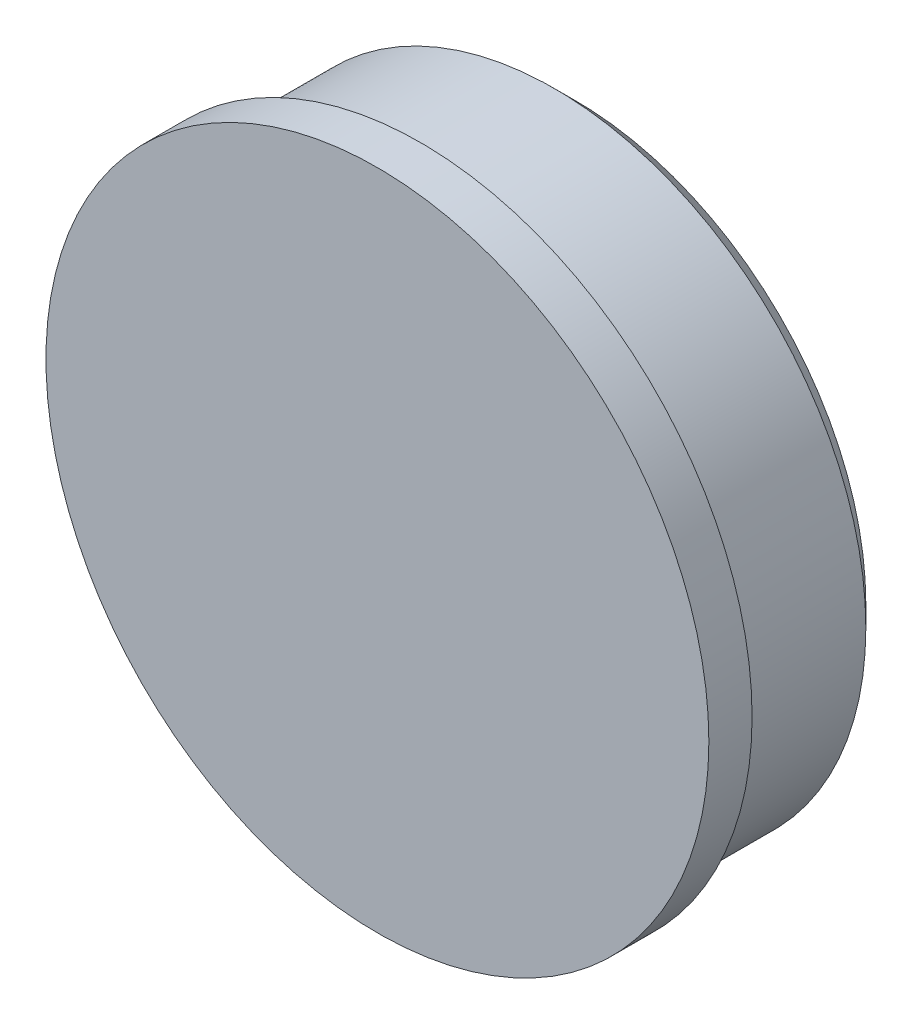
ISO-10303-21;
HEADER;
FILE_DESCRIPTION(('STEP AP214'),'2;1');
FILE_NAME('part.step','',(''),(''),'','','');
FILE_SCHEMA(('AUTOMOTIVE_DESIGN { 1 0 10303 214 1 1 1 1 }'));
ENDSEC;
DATA;
#1=APPLICATION_CONTEXT('core data for automotive mechanical design processes');
#2=APPLICATION_PROTOCOL_DEFINITION('international standard','automotive_design',2000,#1);
#3=PRODUCT_CONTEXT('',#1,'mechanical');
#4=PRODUCT('Part','Part','',(#3));
#5=PRODUCT_RELATED_PRODUCT_CATEGORY('part','',(#4));
#6=PRODUCT_DEFINITION_FORMATION('','',#4);
#7=PRODUCT_DEFINITION_CONTEXT('part definition',#1,'design');
#8=PRODUCT_DEFINITION('design','',#6,#7);
#9=PRODUCT_DEFINITION_SHAPE('','',#8);
#10=(LENGTH_UNIT() NAMED_UNIT(*) SI_UNIT(.MILLI.,.METRE.));
#11=(NAMED_UNIT(*) PLANE_ANGLE_UNIT() SI_UNIT($,.RADIAN.));
#12=(NAMED_UNIT(*) SI_UNIT($,.STERADIAN.) SOLID_ANGLE_UNIT());
#13=UNCERTAINTY_MEASURE_WITH_UNIT(LENGTH_MEASURE(1.E-05),#10,'distance_accuracy_value','');
#14=(GEOMETRIC_REPRESENTATION_CONTEXT(3) GLOBAL_UNCERTAINTY_ASSIGNED_CONTEXT((#13)) GLOBAL_UNIT_ASSIGNED_CONTEXT((#10,
#11,#12)) REPRESENTATION_CONTEXT('',''));
#15=CARTESIAN_POINT('',(0.,0.,0.));
#16=DIRECTION('',(0.,0.,1.));
#17=DIRECTION('',(1.,0.,0.));
#18=AXIS2_PLACEMENT_3D('',#15,#16,#17);
#19=CARTESIAN_POINT('',(0.,0.,0.));
#20=DIRECTION('',(0.,0.,-1.));
#21=DIRECTION('',(-1.,0.,0.));
#22=AXIS2_PLACEMENT_3D('',#19,#20,#21);
#23=PLANE('',#22);
#24=CARTESIAN_POINT('',(0.,0.,0.));
#25=DIRECTION('',(0.,0.,1.));
#26=DIRECTION('',(1.,0.,0.));
#27=AXIS2_PLACEMENT_3D('',#24,#25,#26);
#28=CIRCLE('',#27,12.6365);
#29=CARTESIAN_POINT('',(12.6365,0.,0.));
#30=VERTEX_POINT('',#29);
#31=EDGE_CURVE('E10',#30,#30,#28,.T.);
#32=ORIENTED_EDGE('',*,*,#31,.T.);
#33=EDGE_LOOP('',(#32));
#34=FACE_BOUND('',#33,.T.);
#35=ADVANCED_FACE('F33',(#34),#23,.F.);
#36=CARTESIAN_POINT('',(0.,0.,0.));
#37=DIRECTION('',(0.,0.,1.));
#38=DIRECTION('',(1.,0.,0.));
#39=AXIS2_PLACEMENT_3D('',#36,#37,#38);
#40=CYLINDRICAL_SURFACE('',#39,12.6365);
#41=ORIENTED_EDGE('',*,*,#31,.F.);
#42=EDGE_LOOP('',(#41));
#43=FACE_BOUND('',#42,.T.);
#44=CARTESIAN_POINT('',(0.,0.,-1.647825));
#45=DIRECTION('',(0.,0.,1.));
#46=DIRECTION('',(1.,0.,0.));
#47=AXIS2_PLACEMENT_3D('',#44,#45,#46);
#48=CIRCLE('',#47,12.6365);
#49=CARTESIAN_POINT('',(12.6365,0.,-1.647825));
#50=VERTEX_POINT('',#49);
#51=EDGE_CURVE('E39',#50,#50,#48,.T.);
#52=ORIENTED_EDGE('',*,*,#51,.T.);
#53=EDGE_LOOP('',(#52));
#54=FACE_BOUND('',#53,.T.);
#55=ADVANCED_FACE('F68',(#43,#54),#40,.T.);
#56=CARTESIAN_POINT('',(0.,12.6365,-1.647825));
#57=DIRECTION('',(0.,0.,1.));
#58=DIRECTION('',(1.,0.,0.));
#59=AXIS2_PLACEMENT_3D('',#56,#57,#58);
#60=PLANE('',#59);
#61=ORIENTED_EDGE('',*,*,#51,.F.);
#62=EDGE_LOOP('',(#61));
#63=FACE_BOUND('',#62,.T.);
#64=CARTESIAN_POINT('',(0.,0.,-1.647825));
#65=DIRECTION('',(0.,0.,1.));
#66=DIRECTION('',(1.,0.,0.));
#67=AXIS2_PLACEMENT_3D('',#64,#65,#66);
#68=CIRCLE('',#67,11.8745);
#69=CARTESIAN_POINT('',(11.8745,0.,-1.647825));
#70=VERTEX_POINT('',#69);
#71=EDGE_CURVE('E43',#70,#70,#68,.T.);
#72=ORIENTED_EDGE('',*,*,#71,.T.);
#73=EDGE_LOOP('',(#72));
#74=FACE_BOUND('',#73,.T.);
#75=ADVANCED_FACE('F72',(#63,#74),#60,.F.);
#76=CARTESIAN_POINT('',(0.,0.,0.));
#77=DIRECTION('',(0.,0.,1.));
#78=DIRECTION('',(1.,0.,0.));
#79=AXIS2_PLACEMENT_3D('',#76,#77,#78);
#80=CYLINDRICAL_SURFACE('',#79,11.8745);
#81=ORIENTED_EDGE('',*,*,#71,.F.);
#82=EDGE_LOOP('',(#81));
#83=FACE_BOUND('',#82,.T.);
#84=CARTESIAN_POINT('',(0.,0.,-6.746875));
#85=DIRECTION('',(0.,0.,1.));
#86=DIRECTION('',(1.,0.,0.));
#87=AXIS2_PLACEMENT_3D('',#84,#85,#86);
#88=CIRCLE('',#87,11.8745);
#89=CARTESIAN_POINT('',(11.8745,0.,-6.746875));
#90=VERTEX_POINT('',#89);
#91=EDGE_CURVE('E47',#90,#90,#88,.T.);
#92=ORIENTED_EDGE('',*,*,#91,.T.);
#93=EDGE_LOOP('',(#92));
#94=FACE_BOUND('',#93,.T.);
#95=ADVANCED_FACE('F64',(#83,#94),#80,.T.);
#96=CARTESIAN_POINT('',(0.,0.,-7.540625));
#97=DIRECTION('',(0.,0.,1.));
#98=DIRECTION('',(1.,0.,0.));
#99=AXIS2_PLACEMENT_3D('',#96,#97,#98);
#100=CONICAL_SURFACE('',#99,11.08075,0.785398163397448);
#101=ORIENTED_EDGE('',*,*,#91,.F.);
#102=EDGE_LOOP('',(#101));
#103=FACE_BOUND('',#102,.T.);
#104=CARTESIAN_POINT('',(0.,0.,-7.540625));
#105=DIRECTION('',(0.,0.,1.));
#106=DIRECTION('',(1.,0.,0.));
#107=AXIS2_PLACEMENT_3D('',#104,#105,#106);
#108=CIRCLE('',#107,11.08075);
#109=CARTESIAN_POINT('',(11.08075,0.,-7.540625));
#110=VERTEX_POINT('',#109);
#111=EDGE_CURVE('E52',#110,#110,#108,.T.);
#112=ORIENTED_EDGE('',*,*,#111,.T.);
#113=EDGE_LOOP('',(#112));
#114=FACE_BOUND('',#113,.T.);
#115=ADVANCED_FACE('F56',(#103,#114),#100,.T.);
#116=CARTESIAN_POINT('',(0.,11.08075,-7.540625));
#117=DIRECTION('',(0.,0.,1.));
#118=DIRECTION('',(1.,0.,0.));
#119=AXIS2_PLACEMENT_3D('',#116,#117,#118);
#120=PLANE('',#119);
#121=ORIENTED_EDGE('',*,*,#111,.F.);
#122=EDGE_LOOP('',(#121));
#123=FACE_BOUND('',#122,.T.);
#124=ADVANCED_FACE('F58',(#123),#120,.F.);
#125=CLOSED_SHELL('',(#35,#55,#75,#95,#115,#124));
#126=MANIFOLD_SOLID_BREP('B2',#125);
#127=ADVANCED_BREP_SHAPE_REPRESENTATION('',(#18,#126),#14);
#128=SHAPE_DEFINITION_REPRESENTATION(#9,#127);
ENDSEC;
END-ISO-10303-21;
